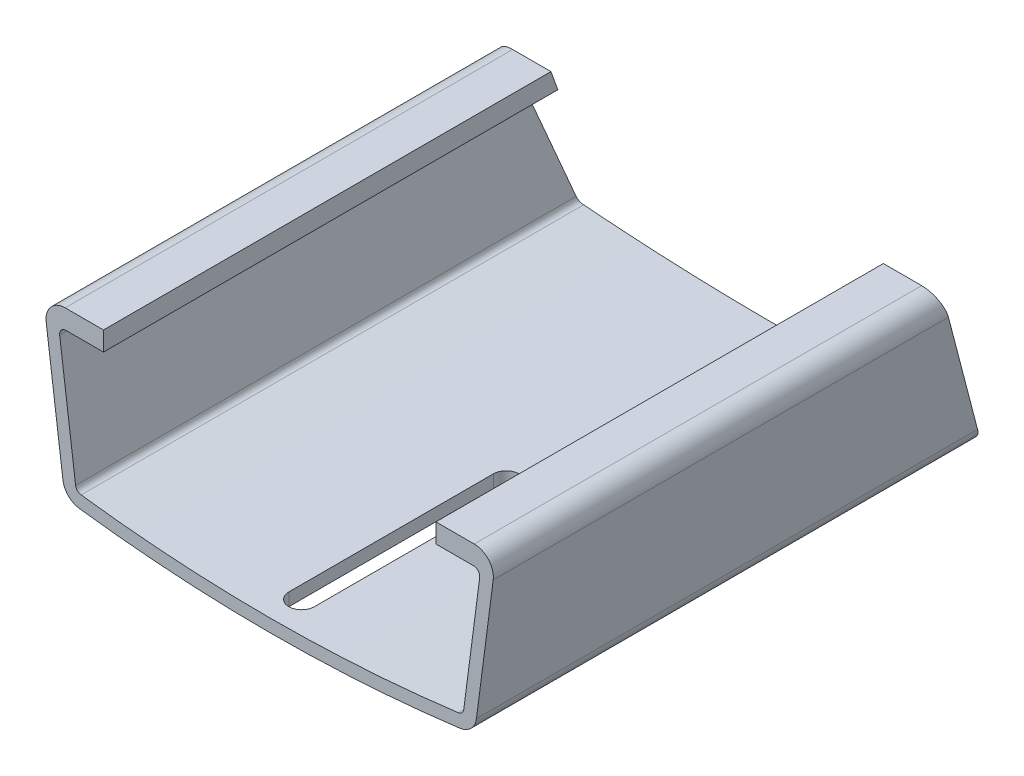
ISO-10303-21;
HEADER;
FILE_DESCRIPTION(('STEP AP214'),'2;1');
FILE_NAME('part.step','',(''),(''),'','','');
FILE_SCHEMA(('AUTOMOTIVE_DESIGN { 1 0 10303 214 1 1 1 1 }'));
ENDSEC;
DATA;
#1=APPLICATION_CONTEXT('core data for automotive mechanical design processes');
#2=APPLICATION_PROTOCOL_DEFINITION('international standard','automotive_design',2000,#1);
#3=PRODUCT_CONTEXT('',#1,'mechanical');
#4=PRODUCT('Part','Part','',(#3));
#5=PRODUCT_RELATED_PRODUCT_CATEGORY('part','',(#4));
#6=PRODUCT_DEFINITION_FORMATION('','',#4);
#7=PRODUCT_DEFINITION_CONTEXT('part definition',#1,'design');
#8=PRODUCT_DEFINITION('design','',#6,#7);
#9=PRODUCT_DEFINITION_SHAPE('','',#8);
#10=(LENGTH_UNIT() NAMED_UNIT(*) SI_UNIT(.MILLI.,.METRE.));
#11=(NAMED_UNIT(*) PLANE_ANGLE_UNIT() SI_UNIT($,.RADIAN.));
#12=(NAMED_UNIT(*) SI_UNIT($,.STERADIAN.) SOLID_ANGLE_UNIT());
#13=UNCERTAINTY_MEASURE_WITH_UNIT(LENGTH_MEASURE(1.E-05),#10,'distance_accuracy_value','');
#14=(GEOMETRIC_REPRESENTATION_CONTEXT(3) GLOBAL_UNCERTAINTY_ASSIGNED_CONTEXT((#13)) GLOBAL_UNIT_ASSIGNED_CONTEXT((#10,
#11,#12)) REPRESENTATION_CONTEXT('',''));
#15=CARTESIAN_POINT('',(0.,0.,0.));
#16=DIRECTION('',(0.,0.,1.));
#17=DIRECTION('',(1.,0.,0.));
#18=AXIS2_PLACEMENT_3D('',#15,#16,#17);
#19=CARTESIAN_POINT('',(-29.3686974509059,2.89162279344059,80.));
#20=DIRECTION('',(0.,0.,-1.));
#21=DIRECTION('',(-1.,0.,0.));
#22=AXIS2_PLACEMENT_3D('',#19,#20,#21);
#23=CYLINDRICAL_SURFACE('',#22,1.00000000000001);
#24=DIRECTION('',(0.,0.,-1.));
#25=VECTOR('',#24,1.);
#26=CARTESIAN_POINT('',(-29.4969842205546,1.89988567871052,80.));
#27=LINE('',#26,#25);
#28=CARTESIAN_POINT('',(-29.4969842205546,1.89988567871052,80.));
#29=VERTEX_POINT('',#28);
#30=CARTESIAN_POINT('',(-29.4969842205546,1.89988567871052,1.39281631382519));
#31=VERTEX_POINT('',#30);
#32=EDGE_CURVE('E401',#29,#31,#27,.T.);
#33=ORIENTED_EDGE('',*,*,#32,.T.);
#34=CARTESIAN_POINT('',(-29.3686974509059,2.89162279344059,1.74700814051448));
#35=DIRECTION('',(0.,-0.336336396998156,0.941741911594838));
#36=DIRECTION('',(0.,-0.941741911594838,-0.336336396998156));
#37=AXIS2_PLACEMENT_3D('',#34,#35,#36);
#38=ELLIPSE('',#37,1.0618620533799,1.00000000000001);
#39=CARTESIAN_POINT('',(-30.3602978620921,2.76228360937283,1.70081557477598));
#40=VERTEX_POINT('',#39);
#41=EDGE_CURVE('E330',#31,#40,#38,.F.);
#42=ORIENTED_EDGE('',*,*,#41,.T.);
#43=DIRECTION('',(0.,0.,-1.));
#44=VECTOR('',#43,1.);
#45=CARTESIAN_POINT('',(-30.3602978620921,2.76228360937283,80.));
#46=LINE('',#45,#44);
#47=CARTESIAN_POINT('',(-30.3602978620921,2.76228360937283,80.));
#48=VERTEX_POINT('',#47);
#49=EDGE_CURVE('E220',#48,#40,#46,.T.);
#50=ORIENTED_EDGE('',*,*,#49,.F.);
#51=CARTESIAN_POINT('',(-29.3686974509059,2.89162279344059,80.));
#52=DIRECTION('',(0.,0.,-1.));
#53=DIRECTION('',(1.,0.,0.));
#54=AXIS2_PLACEMENT_3D('',#51,#52,#53);
#55=CIRCLE('',#54,1.00000000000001);
#56=EDGE_CURVE('E284',#29,#48,#55,.T.);
#57=ORIENTED_EDGE('',*,*,#56,.F.);
#58=EDGE_LOOP('',(#33,#42,#50,#57));
#59=FACE_BOUND('',#58,.T.);
#60=ADVANCED_FACE('F31',(#59),#23,.F.);
#61=CARTESIAN_POINT('',(-30.3602978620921,2.76228360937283,80.));
#62=DIRECTION('',(-0.991600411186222,-0.129339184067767,0.));
#63=DIRECTION('',(0.129339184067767,-0.991600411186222,0.));
#64=AXIS2_PLACEMENT_3D('',#61,#62,#63);
#65=PLANE('',#64);
#66=ORIENTED_EDGE('',*,*,#49,.T.);
#67=DIRECTION('',(-0.121919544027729,0.934716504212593,0.333827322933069));
#68=VECTOR('',#67,1.);
#69=CARTESIAN_POINT('',(-33.5470805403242,27.1942841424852,10.4265300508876));
#70=LINE('',#69,#68);
#71=CARTESIAN_POINT('',(-32.8526948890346,21.8706608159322,8.52523600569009));
#72=VERTEX_POINT('',#71);
#73=EDGE_CURVE('E325',#40,#72,#70,.T.);
#74=ORIENTED_EDGE('',*,*,#73,.T.);
#75=DIRECTION('',(0.,0.,-1.));
#76=VECTOR('',#75,1.);
#77=CARTESIAN_POINT('',(-32.8526948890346,21.8706608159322,80.));
#78=LINE('',#77,#76);
#79=CARTESIAN_POINT('',(-32.8526948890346,21.8706608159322,80.));
#80=VERTEX_POINT('',#79);
#81=EDGE_CURVE('E437',#80,#72,#78,.T.);
#82=ORIENTED_EDGE('',*,*,#81,.F.);
#83=DIRECTION('',(-0.129339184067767,0.991600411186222,0.));
#84=VECTOR('',#83,1.);
#85=CARTESIAN_POINT('',(-30.3602978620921,2.76228360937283,80.));
#86=LINE('',#85,#84);
#87=EDGE_CURVE('E444',#48,#80,#86,.T.);
#88=ORIENTED_EDGE('',*,*,#87,.F.);
#89=EDGE_LOOP('',(#66,#74,#82,#88));
#90=FACE_BOUND('',#89,.T.);
#91=ADVANCED_FACE('F442',(#90),#65,.F.);
#92=CARTESIAN_POINT('',(-31.8610944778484,22.,80.));
#93=DIRECTION('',(0.,0.,-1.));
#94=DIRECTION('',(-1.,0.,0.));
#95=AXIS2_PLACEMENT_3D('',#92,#93,#94);
#96=CYLINDRICAL_SURFACE('',#95,0.999999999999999);
#97=ORIENTED_EDGE('',*,*,#81,.T.);
#98=CARTESIAN_POINT('',(-31.8610944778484,22.,8.57142857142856));
#99=DIRECTION('',(0.,-0.336336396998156,0.941741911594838));
#100=DIRECTION('',(0.,-0.941741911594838,-0.336336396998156));
#101=AXIS2_PLACEMENT_3D('',#98,#99,#100);
#102=ELLIPSE('',#101,1.06186205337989,0.999999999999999);
#103=CARTESIAN_POINT('',(-31.8610944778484,23.,8.92857142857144));
#104=VERTEX_POINT('',#103);
#105=EDGE_CURVE('E320',#72,#104,#102,.F.);
#106=ORIENTED_EDGE('',*,*,#105,.T.);
#107=DIRECTION('',(0.,0.,-1.));
#108=VECTOR('',#107,1.);
#109=CARTESIAN_POINT('',(-31.8610944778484,23.,80.));
#110=LINE('',#109,#108);
#111=CARTESIAN_POINT('',(-31.8610944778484,23.,80.));
#112=VERTEX_POINT('',#111);
#113=EDGE_CURVE('E435',#112,#104,#110,.T.);
#114=ORIENTED_EDGE('',*,*,#113,.F.);
#115=CARTESIAN_POINT('',(-31.8610944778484,22.,80.));
#116=DIRECTION('',(0.,0.,-1.));
#117=DIRECTION('',(1.,0.,0.));
#118=AXIS2_PLACEMENT_3D('',#115,#116,#117);
#119=CIRCLE('',#118,0.999999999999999);
#120=EDGE_CURVE('E470',#80,#112,#119,.T.);
#121=ORIENTED_EDGE('',*,*,#120,.F.);
#122=EDGE_LOOP('',(#97,#106,#114,#121));
#123=FACE_BOUND('',#122,.T.);
#124=ADVANCED_FACE('F505',(#123),#96,.F.);
#125=CARTESIAN_POINT('',(-31.8610944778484,23.,80.));
#126=DIRECTION('',(0.,1.,0.));
#127=DIRECTION('',(0.,0.,1.));
#128=AXIS2_PLACEMENT_3D('',#125,#126,#127);
#129=PLANE('',#128);
#130=ORIENTED_EDGE('',*,*,#113,.T.);
#131=DIRECTION('',(1.,0.,0.));
#132=VECTOR('',#131,1.);
#133=CARTESIAN_POINT('',(-31.8610944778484,23.,8.92857142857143));
#134=LINE('',#133,#132);
#135=CARTESIAN_POINT('',(-26.,23.,8.92857142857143));
#136=VERTEX_POINT('',#135);
#137=EDGE_CURVE('E316',#104,#136,#134,.T.);
#138=ORIENTED_EDGE('',*,*,#137,.T.);
#139=DIRECTION('',(0.,0.,-1.));
#140=VECTOR('',#139,1.);
#141=CARTESIAN_POINT('',(-26.,23.,80.));
#142=LINE('',#141,#140);
#143=CARTESIAN_POINT('',(-26.,23.,80.));
#144=VERTEX_POINT('',#143);
#145=EDGE_CURVE('E433',#144,#136,#142,.T.);
#146=ORIENTED_EDGE('',*,*,#145,.F.);
#147=DIRECTION('',(1.,0.,0.));
#148=VECTOR('',#147,1.);
#149=CARTESIAN_POINT('',(-31.8610944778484,23.,80.));
#150=LINE('',#149,#148);
#151=EDGE_CURVE('E471',#112,#144,#150,.T.);
#152=ORIENTED_EDGE('',*,*,#151,.F.);
#153=EDGE_LOOP('',(#130,#138,#146,#152));
#154=FACE_BOUND('',#153,.T.);
#155=ADVANCED_FACE('F498',(#154),#129,.F.);
#156=CARTESIAN_POINT('',(-26.,23.,80.));
#157=DIRECTION('',(-1.,0.,0.));
#158=DIRECTION('',(0.,0.,1.));
#159=AXIS2_PLACEMENT_3D('',#156,#157,#158);
#160=PLANE('',#159);
#161=ORIENTED_EDGE('',*,*,#145,.T.);
#162=DIRECTION('',(0.,0.941741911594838,0.336336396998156));
#163=VECTOR('',#162,1.);
#164=CARTESIAN_POINT('',(-26.,45.5113122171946,16.9683257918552));
#165=LINE('',#164,#163);
#166=CARTESIAN_POINT('',(-26.,26.,10.));
#167=VERTEX_POINT('',#166);
#168=EDGE_CURVE('E313',#136,#167,#165,.T.);
#169=ORIENTED_EDGE('',*,*,#168,.T.);
#170=DIRECTION('',(0.,0.,-1.));
#171=VECTOR('',#170,1.);
#172=CARTESIAN_POINT('',(-26.,26.,80.));
#173=LINE('',#172,#171);
#174=CARTESIAN_POINT('',(-26.,26.,80.));
#175=VERTEX_POINT('',#174);
#176=EDGE_CURVE('E209',#175,#167,#173,.T.);
#177=ORIENTED_EDGE('',*,*,#176,.F.);
#178=DIRECTION('',(0.,1.,0.));
#179=VECTOR('',#178,1.);
#180=CARTESIAN_POINT('',(-26.,23.,80.));
#181=LINE('',#180,#179);
#182=EDGE_CURVE('E475',#144,#175,#181,.T.);
#183=ORIENTED_EDGE('',*,*,#182,.F.);
#184=EDGE_LOOP('',(#161,#169,#177,#183));
#185=FACE_BOUND('',#184,.T.);
#186=ADVANCED_FACE('F496',(#185),#160,.F.);
#187=CARTESIAN_POINT('',(-26.,26.,80.));
#188=DIRECTION('',(0.,-1.,0.));
#189=DIRECTION('',(0.,0.,-1.));
#190=AXIS2_PLACEMENT_3D('',#187,#188,#189);
#191=PLANE('',#190);
#192=ORIENTED_EDGE('',*,*,#176,.T.);
#193=DIRECTION('',(1.,0.,0.));
#194=VECTOR('',#193,1.);
#195=CARTESIAN_POINT('',(-34.9915292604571,26.,10.));
#196=LINE('',#195,#194);
#197=CARTESIAN_POINT('',(-31.9915292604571,26.,10.));
#198=VERTEX_POINT('',#197);
#199=EDGE_CURVE('E192',#198,#167,#196,.T.);
#200=ORIENTED_EDGE('',*,*,#199,.F.);
#201=DIRECTION('',(0.,0.,-1.));
#202=VECTOR('',#201,1.);
#203=CARTESIAN_POINT('',(-31.9915292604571,26.,80.));
#204=LINE('',#203,#202);
#205=CARTESIAN_POINT('',(-31.9915292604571,26.,80.));
#206=VERTEX_POINT('',#205);
#207=EDGE_CURVE('E206',#198,#206,#204,.F.);
#208=ORIENTED_EDGE('',*,*,#207,.T.);
#209=DIRECTION('',(-1.,0.,0.));
#210=VECTOR('',#209,1.);
#211=CARTESIAN_POINT('',(-26.,26.,80.));
#212=LINE('',#211,#210);
#213=EDGE_CURVE('E477',#175,#206,#212,.T.);
#214=ORIENTED_EDGE('',*,*,#213,.F.);
#215=EDGE_LOOP('',(#192,#200,#208,#214));
#216=FACE_BOUND('',#215,.T.);
#217=ADVANCED_FACE('F204',(#216),#191,.F.);
#218=CARTESIAN_POINT('',(-32.3434986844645,2.50360524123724,80.));
#219=DIRECTION('',(0.991600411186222,0.129339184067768,0.));
#220=DIRECTION('',(-0.129339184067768,0.991600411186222,0.));
#221=AXIS2_PLACEMENT_3D('',#218,#219,#220);
#222=PLANE('',#221);
#223=DIRECTION('',(0.,0.,-1.));
#224=VECTOR('',#223,1.);
#225=CARTESIAN_POINT('',(-34.9663304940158,22.6119824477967,80.));
#226=LINE('',#225,#224);
#227=CARTESIAN_POINT('',(-34.9663304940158,22.6119824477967,80.));
#228=VERTEX_POINT('',#227);
#229=CARTESIAN_POINT('',(-34.9663304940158,22.6119824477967,8.78999373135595));
#230=VERTEX_POINT('',#229);
#231=EDGE_CURVE('E217',#228,#230,#226,.T.);
#232=ORIENTED_EDGE('',*,*,#231,.T.);
#233=DIRECTION('',(0.12191954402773,-0.934716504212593,-0.333827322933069));
#234=VECTOR('',#233,1.);
#235=CARTESIAN_POINT('',(-35.5340414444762,26.9644330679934,10.3444403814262));
#236=LINE('',#235,#234);
#237=CARTESIAN_POINT('',(-32.3434986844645,2.50360524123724,1.608430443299));
#238=VERTEX_POINT('',#237);
#239=EDGE_CURVE('E195',#230,#238,#236,.T.);
#240=ORIENTED_EDGE('',*,*,#239,.T.);
#241=DIRECTION('',(0.,0.,-1.));
#242=VECTOR('',#241,1.);
#243=CARTESIAN_POINT('',(-32.3434986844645,2.50360524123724,80.));
#244=LINE('',#243,#242);
#245=CARTESIAN_POINT('',(-32.3434986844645,2.50360524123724,80.));
#246=VERTEX_POINT('',#245);
#247=EDGE_CURVE('E429',#246,#238,#244,.T.);
#248=ORIENTED_EDGE('',*,*,#247,.F.);
#249=DIRECTION('',(0.129339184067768,-0.991600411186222,0.));
#250=VECTOR('',#249,1.);
#251=CARTESIAN_POINT('',(-32.3434986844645,2.50360524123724,80.));
#252=LINE('',#251,#250);
#253=EDGE_CURVE('E479',#228,#246,#252,.T.);
#254=ORIENTED_EDGE('',*,*,#253,.F.);
#255=EDGE_LOOP('',(#232,#240,#248,#254));
#256=FACE_BOUND('',#255,.T.);
#257=ADVANCED_FACE('F493',(#256),#222,.F.);
#258=CARTESIAN_POINT('',(-29.3686974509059,2.89162279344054,80.));
#259=DIRECTION('',(0.,0.,-1.));
#260=DIRECTION('',(-1.,0.,0.));
#261=AXIS2_PLACEMENT_3D('',#258,#259,#260);
#262=CYLINDRICAL_SURFACE('',#261,2.99999999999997);
#263=ORIENTED_EDGE('',*,*,#247,.T.);
#264=CARTESIAN_POINT('',(-29.3686974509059,2.89162279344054,1.74700814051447));
#265=DIRECTION('',(0.,-0.336336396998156,0.941741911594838));
#266=DIRECTION('',(0.,-0.941741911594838,-0.336336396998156));
#267=AXIS2_PLACEMENT_3D('',#264,#265,#266);
#268=ELLIPSE('',#267,3.18558616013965,2.99999999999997);
#269=CARTESIAN_POINT('',(-29.7535577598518,-0.0835885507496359,0.684432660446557));
#270=VERTEX_POINT('',#269);
#271=EDGE_CURVE('E351',#238,#270,#268,.T.);
#272=ORIENTED_EDGE('',*,*,#271,.T.);
#273=DIRECTION('',(0.,0.,-1.));
#274=VECTOR('',#273,1.);
#275=CARTESIAN_POINT('',(-29.7535577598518,-0.0835885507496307,80.));
#276=LINE('',#275,#274);
#277=CARTESIAN_POINT('',(-29.7535577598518,-0.0835885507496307,80.));
#278=VERTEX_POINT('',#277);
#279=EDGE_CURVE('E426',#278,#270,#276,.T.);
#280=ORIENTED_EDGE('',*,*,#279,.F.);
#281=CARTESIAN_POINT('',(-29.3686974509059,2.89162279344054,80.));
#282=DIRECTION('',(0.,0.,1.));
#283=DIRECTION('',(1.,0.,0.));
#284=AXIS2_PLACEMENT_3D('',#281,#282,#283);
#285=CIRCLE('',#284,2.99999999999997);
#286=EDGE_CURVE('E481',#246,#278,#285,.T.);
#287=ORIENTED_EDGE('',*,*,#286,.F.);
#288=EDGE_LOOP('',(#263,#272,#280,#287));
#289=FACE_BOUND('',#288,.T.);
#290=ADVANCED_FACE('F275',(#289),#262,.T.);
#291=CARTESIAN_POINT('',(0.,229.930056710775,80.));
#292=DIRECTION('',(0.,0.,-1.));
#293=DIRECTION('',(-1.,0.,0.));
#294=AXIS2_PLACEMENT_3D('',#291,#292,#293);
#295=CYLINDRICAL_SURFACE('',#294,231.930056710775);
#296=DIRECTION('',(0.,0.,-1.));
#297=VECTOR('',#296,1.);
#298=CARTESIAN_POINT('',(2.00000000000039,-1.99137655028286,80.));
#299=LINE('',#298,#297);
#300=CARTESIAN_POINT('',(2.00000000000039,-1.99137655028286,75.));
#301=VERTEX_POINT('',#300);
#302=CARTESIAN_POINT('',(2.00000000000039,-1.99137655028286,43.));
#303=VERTEX_POINT('',#302);
#304=EDGE_CURVE('E266',#301,#303,#299,.T.);
#305=ORIENTED_EDGE('',*,*,#304,.T.);
#306=CARTESIAN_POINT('',(2.00000000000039,-1.99137655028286,43.));
#307=CARTESIAN_POINT('',(1.99999962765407,-1.99137643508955,42.943733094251));
#308=CARTESIAN_POINT('',(1.99762403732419,-1.99139705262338,42.8874931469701));
#309=CARTESIAN_POINT('',(1.98814684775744,-1.99147853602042,42.7754156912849));
#310=CARTESIAN_POINT('',(1.98104547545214,-1.991539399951,42.7195781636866));
#311=CARTESIAN_POINT('',(1.95271918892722,-1.9917802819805,42.5533610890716));
#312=CARTESIAN_POINT('',(1.92447192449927,-1.99201859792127,42.4440950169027));
#313=CARTESIAN_POINT('',(1.85003577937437,-1.99262424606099,42.2318613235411));
#314=CARTESIAN_POINT('',(1.80383858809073,-1.99299163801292,42.1288966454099));
#315=CARTESIAN_POINT('',(1.69482021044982,-1.9938138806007,41.9321895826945));
#316=CARTESIAN_POINT('',(1.63200228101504,-1.99426871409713,41.838445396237));
#317=CARTESIAN_POINT('',(1.49151930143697,-1.99521464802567,41.6628323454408));
#318=CARTESIAN_POINT('',(1.41385358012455,-1.99570575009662,41.5809640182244));
#319=CARTESIAN_POINT('',(1.24586778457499,-1.99666891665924,41.4314144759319));
#320=CARTESIAN_POINT('',(1.15554578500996,-1.9971409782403,41.3637354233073));
#321=CARTESIAN_POINT('',(0.964823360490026,-1.99801274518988,41.2445047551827));
#322=CARTESIAN_POINT('',(0.864423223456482,-1.99841245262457,41.1929526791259));
#323=CARTESIAN_POINT('',(0.656399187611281,-1.99909443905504,41.1074393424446));
#324=CARTESIAN_POINT('',(0.548775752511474,-1.99937672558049,41.0734769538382));
#325=CARTESIAN_POINT('',(0.329354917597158,-1.99979208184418,41.0241024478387));
#326=CARTESIAN_POINT('',(0.217557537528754,-1.99992515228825,41.0086902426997));
#327=CARTESIAN_POINT('',(-0.00704057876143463,-2.00002707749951,40.9968532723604));
#328=CARTESIAN_POINT('',(-0.119841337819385,-1.99999592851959,41.0004289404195));
#329=CARTESIAN_POINT('',(-0.34323723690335,-1.99977292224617,41.0264667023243));
#330=CARTESIAN_POINT('',(-0.453832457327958,-1.99958107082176,41.0489281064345));
#331=CARTESIAN_POINT('',(-0.669681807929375,-1.99905829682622,41.1120986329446));
#332=CARTESIAN_POINT('',(-0.774935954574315,-1.99872737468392,41.1528076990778));
#333=CARTESIAN_POINT('',(-0.977119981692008,-1.99796374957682,41.2513196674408));
#334=CARTESIAN_POINT('',(-1.07404953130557,-1.99753104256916,41.3091232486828));
#335=CARTESIAN_POINT('',(-1.25682387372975,-1.99661266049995,41.440180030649));
#336=CARTESIAN_POINT('',(-1.3426692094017,-1.9961269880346,41.5134324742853));
#337=CARTESIAN_POINT('',(-1.50083614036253,-1.995157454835,41.6732994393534));
#338=CARTESIAN_POINT('',(-1.57315911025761,-1.99467359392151,41.7599126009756));
#339=CARTESIAN_POINT('',(-1.70226068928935,-1.99376202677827,41.9440854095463));
#340=CARTESIAN_POINT('',(-1.75903435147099,-1.99333433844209,42.0416485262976));
#341=CARTESIAN_POINT('',(-1.855422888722,-1.99258329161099,42.2449633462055));
#342=CARTESIAN_POINT('',(-1.89502730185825,-1.99225999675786,42.3507199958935));
#343=CARTESIAN_POINT('',(-1.95585799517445,-1.99175504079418,42.5672991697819));
#344=CARTESIAN_POINT('',(-1.97711234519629,-1.99157316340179,42.6781136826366));
#345=CARTESIAN_POINT('',(-1.99261621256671,-1.99144011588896,42.8247205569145));
#346=CARTESIAN_POINT('',(-1.99538659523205,-1.99141629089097,42.8597500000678));
#347=CARTESIAN_POINT('',(-1.99907596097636,-1.99138452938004,42.9298482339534));
#348=CARTESIAN_POINT('',(-1.99999799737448,-1.99137656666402,42.9649168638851));
#349=CARTESIAN_POINT('',(-1.99999999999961,-1.99137655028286,43.));
#350=B_SPLINE_CURVE_WITH_KNOTS('',3,(#306,#307,#308,#309,#310,#311,#312,#313,#314,#315,#316,
#317,#318,#319,#320,#321,#322,#323,#324,#325,#326,#327,#328,#329,#330,#331,#332,#333,#334,#335,
#336,#337,#338,#339,#340,#341,#342,#343,#344,#345,#346,#347,#348,#349),.UNSPECIFIED.,.F.,.F.,(4,
2,2,2,2,2,2,2,2,2,2,2,2,2,2,2,2,2,2,2,2,4),(0.,0.16869703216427,0.337385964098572,
0.674224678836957,1.01121953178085,1.3481483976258,1.6850924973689,2.02208791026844,
2.35907369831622,2.69603787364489,3.03300045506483,3.36997072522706,3.70692868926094,
4.04388561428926,4.38085592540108,4.71780972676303,5.05472925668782,5.39175585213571,
5.72898752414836,6.06570241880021,6.17108493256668,6.27629321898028),.UNSPECIFIED.);
#351=CARTESIAN_POINT('',(-1.99999999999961,-1.99137655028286,43.));
#352=VERTEX_POINT('',#351);
#353=EDGE_CURVE('E258',#303,#352,#350,.T.);
#354=ORIENTED_EDGE('',*,*,#353,.T.);
#355=DIRECTION('',(0.,0.,-1.));
#356=VECTOR('',#355,1.);
#357=CARTESIAN_POINT('',(-1.99999999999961,-1.99137655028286,80.));
#358=LINE('',#357,#356);
#359=CARTESIAN_POINT('',(-1.99999999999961,-1.99137655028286,75.));
#360=VERTEX_POINT('',#359);
#361=EDGE_CURVE('E265',#352,#360,#358,.F.);
#362=ORIENTED_EDGE('',*,*,#361,.T.);
#363=CARTESIAN_POINT('',(3.89046133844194E-13,-2.00000000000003,77.));
#364=CARTESIAN_POINT('',(0.112338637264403,-1.99999988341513,76.9999950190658));
#365=CARTESIAN_POINT('',(0.224758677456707,-1.99991750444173,76.9905032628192));
#366=CARTESIAN_POINT('',(0.446502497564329,-1.99959679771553,76.952770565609));
#367=CARTESIAN_POINT('',(0.555822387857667,-1.99935828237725,76.9245070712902));
#368=CARTESIAN_POINT('',(0.768121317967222,-1.99875232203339,76.8500356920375));
#369=CARTESIAN_POINT('',(0.87110336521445,-1.99838493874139,76.8038363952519));
#370=CARTESIAN_POINT('',(1.06782073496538,-1.99756271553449,76.6948166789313));
#371=CARTESIAN_POINT('',(1.16155834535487,-1.99710789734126,76.6320003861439));
#372=CARTESIAN_POINT('',(1.33717117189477,-1.9961619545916,76.4915153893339));
#373=CARTESIAN_POINT('',(1.41904486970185,-1.99567082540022,76.4138447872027));
#374=CARTESIAN_POINT('',(1.56859359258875,-1.99470765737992,76.2458575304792));
#375=CARTESIAN_POINT('',(1.63626805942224,-1.99423561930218,76.1555403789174));
#376=CARTESIAN_POINT('',(1.75549328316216,-1.99336387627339,75.9648263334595));
#377=CARTESIAN_POINT('',(1.8070440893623,-1.99296417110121,75.8644294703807));
#378=CARTESIAN_POINT('',(1.89255857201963,-1.99228215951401,75.6564058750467));
#379=CARTESIAN_POINT('',(1.92652228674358,-1.99199985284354,75.5487791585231));
#380=CARTESIAN_POINT('',(1.97589785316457,-1.9915844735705,75.3293535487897));
#381=CARTESIAN_POINT('',(1.99131013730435,-1.99145139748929,75.2175547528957));
#382=CARTESIAN_POINT('',(2.00314664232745,-1.99134947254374,74.9929566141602));
#383=CARTESIAN_POINT('',(1.99957090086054,-1.99138062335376,74.8801572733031));
#384=CARTESIAN_POINT('',(1.97353332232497,-1.99160363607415,74.6567630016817));
#385=CARTESIAN_POINT('',(1.9510719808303,-1.99179549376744,74.5461680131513));
#386=CARTESIAN_POINT('',(1.88790154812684,-1.99231828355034,74.3303186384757));
#387=CARTESIAN_POINT('',(1.84719243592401,-1.99264921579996,74.2250642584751));
#388=CARTESIAN_POINT('',(1.74868150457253,-1.99341284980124,74.0228824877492));
#389=CARTESIAN_POINT('',(1.69087945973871,-1.99384555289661,73.9259552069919));
#390=CARTESIAN_POINT('',(1.55982368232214,-1.99476394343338,73.7431803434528));
#391=CARTESIAN_POINT('',(1.48656995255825,-1.99524963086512,73.6573327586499));
#392=CARTESIAN_POINT('',(1.32668739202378,-1.99621925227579,73.4991512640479));
#393=CARTESIAN_POINT('',(1.2400581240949,-1.99670318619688,73.4268177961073));
#394=CARTESIAN_POINT('',(1.05588516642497,-1.99761472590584,73.2977212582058));
#395=CARTESIAN_POINT('',(0.958341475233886,-1.99804233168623,73.2409581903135));
#396=CARTESIAN_POINT('',(0.755108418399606,-1.99879300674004,73.1446138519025));
#397=CARTESIAN_POINT('',(0.649419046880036,-1.99911607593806,73.105032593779));
#398=CARTESIAN_POINT('',(0.432894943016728,-1.99962125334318,73.0441757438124));
#399=CARTESIAN_POINT('',(0.322060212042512,-1.99980336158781,73.0229001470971));
#400=CARTESIAN_POINT('',(0.0983954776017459,-2.00000608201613,72.999259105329));
#401=CARTESIAN_POINT('',(-0.0144344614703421,-2.00002669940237,72.9968930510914));
#402=CARTESIAN_POINT('',(-0.238890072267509,-1.99990412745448,73.0111366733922));
#403=CARTESIAN_POINT('',(-0.350515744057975,-1.99976093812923,73.0277463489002));
#404=CARTESIAN_POINT('',(-0.569392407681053,-1.9993268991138,73.0794694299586));
#405=CARTESIAN_POINT('',(-0.676643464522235,-1.99903605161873,73.1145825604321));
#406=CARTESIAN_POINT('',(-0.883728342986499,-1.99833948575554,73.2023155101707));
#407=CARTESIAN_POINT('',(-0.983562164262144,-1.99793376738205,73.2549353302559));
#408=CARTESIAN_POINT('',(-1.17298139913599,-1.99705318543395,73.3761895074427));
#409=CARTESIAN_POINT('',(-1.26256655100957,-1.99657832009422,73.4448242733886));
#410=CARTESIAN_POINT('',(-1.42894279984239,-1.99561298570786,73.5961594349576));
#411=CARTESIAN_POINT('',(-1.50573388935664,-1.99512251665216,73.6788598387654));
#412=CARTESIAN_POINT('',(-1.64434415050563,-1.99418125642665,73.8559812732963));
#413=CARTESIAN_POINT('',(-1.70616292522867,-1.99373046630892,73.9504026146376));
#414=CARTESIAN_POINT('',(-1.81307094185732,-1.9929194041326,74.1482838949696));
#415=CARTESIAN_POINT('',(-1.85816020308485,-1.99255913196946,74.2517438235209));
#416=CARTESIAN_POINT('',(-1.9303286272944,-1.99196973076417,74.464763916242));
#417=CARTESIAN_POINT('',(-1.95740805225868,-1.99174059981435,74.5743239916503));
#418=CARTESIAN_POINT('',(-1.99278899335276,-1.99143930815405,74.796435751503));
#419=CARTESIAN_POINT('',(-2.00109047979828,-1.9913671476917,74.9089874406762));
#420=CARTESIAN_POINT('',(-1.99867977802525,-1.99138793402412,75.133883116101));
#421=CARTESIAN_POINT('',(-1.98796824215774,-1.99148087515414,75.2462271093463));
#422=CARTESIAN_POINT('',(-1.94783684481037,-1.99182137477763,75.4675223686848));
#423=CARTESIAN_POINT('',(-1.91841694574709,-1.99206893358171,75.5764736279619));
#424=CARTESIAN_POINT('',(-1.84170342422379,-1.99269076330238,75.7878924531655));
#425=CARTESIAN_POINT('',(-1.79440947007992,-1.99306503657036,75.8903598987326));
#426=CARTESIAN_POINT('',(-1.68329242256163,-1.99389808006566,76.0858965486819));
#427=CARTESIAN_POINT('',(-1.61946997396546,-1.99435684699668,76.1789661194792));
#428=CARTESIAN_POINT('',(-1.47711280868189,-1.99530713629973,76.3530637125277));
#429=CARTESIAN_POINT('',(-1.3985791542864,-1.99579865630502,76.4340926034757));
#430=CARTESIAN_POINT('',(-1.229000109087,-1.9967591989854,76.5818363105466));
#431=CARTESIAN_POINT('',(-1.13795161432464,-1.99722821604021,76.6485475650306));
#432=CARTESIAN_POINT('',(-0.945909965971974,-1.99809095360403,76.7657636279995));
#433=CARTESIAN_POINT('',(-0.844911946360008,-1.99848463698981,76.8162604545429));
#434=CARTESIAN_POINT('',(-0.635950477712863,-1.99915154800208,76.8995229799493));
#435=CARTESIAN_POINT('',(-0.527995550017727,-1.99942491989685,76.9323099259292));
#436=CARTESIAN_POINT('',(-0.34946093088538,-1.9997469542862,76.9704876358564));
#437=CARTESIAN_POINT('',(-0.280041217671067,-1.99984143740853,76.9815409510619));
#438=CARTESIAN_POINT('',(-0.140424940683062,-1.99996799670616,76.996298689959));
#439=CARTESIAN_POINT('',(-0.0702283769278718,-2.00000007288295,77.0000031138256));
#440=CARTESIAN_POINT('',(3.89046133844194E-13,-2.00000000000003,77.));
#441=B_SPLINE_CURVE_WITH_KNOTS('',3,(#363,#364,#365,#366,#367,#368,#369,#370,#371,#372,#373,
#374,#375,#376,#377,#378,#379,#380,#381,#382,#383,#384,#385,#386,#387,#388,#389,#390,#391,#392,
#393,#394,#395,#396,#397,#398,#399,#400,#401,#402,#403,#404,#405,#406,#407,#408,#409,#410,#411,
#412,#413,#414,#415,#416,#417,#418,#419,#420,#421,#422,#423,#424,#425,#426,#427,#428,#429,#430,
#431,#432,#433,#434,#435,#436,#437,#438,#439,#440),.UNSPECIFIED.,.T.,.F.,(4,2,2,2,2,2,2,2,2,2,2,
2,2,2,2,2,2,2,2,2,2,2,2,2,2,2,2,2,2,2,2,2,2,2,2,2,2,2,4),(0.,0.336759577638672,
0.673924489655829,1.01092815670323,1.3478482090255,1.68481134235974,2.02178772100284,
2.35876306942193,2.6957376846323,3.03270444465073,3.36967053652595,3.70662778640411,
4.04358542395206,4.38054751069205,4.71750953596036,5.05448257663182,5.39145566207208,
5.72842899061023,6.06540222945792,6.40236461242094,6.73932697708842,7.07628433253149,
7.41324170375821,7.7502076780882,8.08717384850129,8.42414895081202,8.76112366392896,
9.09809347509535,9.43506381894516,9.77202260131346,10.1089820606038,10.4459477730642,
10.7829003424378,11.119828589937,11.4568405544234,11.7940181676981,12.1307903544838,
12.341315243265,12.5518401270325),.UNSPECIFIED.);
#442=EDGE_CURVE('E280',#360,#301,#441,.T.);
#443=ORIENTED_EDGE('',*,*,#442,.T.);
#444=EDGE_LOOP('',(#305,#354,#362,#443));
#445=FACE_BOUND('',#444,.T.);
#446=CARTESIAN_POINT('',(0.,229.930056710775,82.8321631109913));
#447=DIRECTION('',(0.,-0.336336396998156,0.941741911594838));
#448=DIRECTION('',(0.,-0.941741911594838,-0.336336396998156));
#449=AXIS2_PLACEMENT_3D('',#446,#447,#448);
#450=ELLIPSE('',#449,246.277726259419,231.930056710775);
#451=CARTESIAN_POINT('',(29.7535577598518,-0.0835885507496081,0.684432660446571));
#452=VERTEX_POINT('',#451);
#453=EDGE_CURVE('E354',#270,#452,#450,.T.);
#454=ORIENTED_EDGE('',*,*,#453,.T.);
#455=DIRECTION('',(0.,0.,-1.));
#456=VECTOR('',#455,1.);
#457=CARTESIAN_POINT('',(29.7535577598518,-0.0835885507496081,80.));
#458=LINE('',#457,#456);
#459=CARTESIAN_POINT('',(29.7535577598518,-0.0835885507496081,80.));
#460=VERTEX_POINT('',#459);
#461=EDGE_CURVE('E423',#460,#452,#458,.T.);
#462=ORIENTED_EDGE('',*,*,#461,.F.);
#463=CARTESIAN_POINT('',(0.,229.930056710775,80.));
#464=DIRECTION('',(0.,0.,1.));
#465=DIRECTION('',(1.,0.,0.));
#466=AXIS2_PLACEMENT_3D('',#463,#464,#465);
#467=CIRCLE('',#466,231.930056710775);
#468=EDGE_CURVE('E386',#278,#460,#467,.T.);
#469=ORIENTED_EDGE('',*,*,#468,.F.);
#470=ORIENTED_EDGE('',*,*,#279,.T.);
#471=EDGE_LOOP('',(#454,#462,#469,#470));
#472=FACE_BOUND('',#471,.T.);
#473=ADVANCED_FACE('F269',(#445,#472),#295,.T.);
#474=CARTESIAN_POINT('',(29.3686974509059,2.89162279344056,80.));
#475=DIRECTION('',(0.,0.,-1.));
#476=DIRECTION('',(-1.,0.,0.));
#477=AXIS2_PLACEMENT_3D('',#474,#475,#476);
#478=CYLINDRICAL_SURFACE('',#477,2.99999999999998);
#479=ORIENTED_EDGE('',*,*,#461,.T.);
#480=CARTESIAN_POINT('',(29.3686974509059,2.89162279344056,1.74700814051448));
#481=DIRECTION('',(0.,-0.336336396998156,0.941741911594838));
#482=DIRECTION('',(0.,-0.941741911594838,-0.336336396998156));
#483=AXIS2_PLACEMENT_3D('',#480,#481,#482);
#484=ELLIPSE('',#483,3.18558616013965,2.99999999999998);
#485=CARTESIAN_POINT('',(32.3434986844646,2.50360524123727,1.60843044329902));
#486=VERTEX_POINT('',#485);
#487=EDGE_CURVE('E356',#452,#486,#484,.T.);
#488=ORIENTED_EDGE('',*,*,#487,.T.);
#489=DIRECTION('',(0.,0.,-1.));
#490=VECTOR('',#489,1.);
#491=CARTESIAN_POINT('',(32.3434986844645,2.50360524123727,80.));
#492=LINE('',#491,#490);
#493=CARTESIAN_POINT('',(32.3434986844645,2.50360524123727,80.));
#494=VERTEX_POINT('',#493);
#495=EDGE_CURVE('E421',#494,#486,#492,.T.);
#496=ORIENTED_EDGE('',*,*,#495,.F.);
#497=CARTESIAN_POINT('',(29.3686974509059,2.89162279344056,80.));
#498=DIRECTION('',(0.,0.,1.));
#499=DIRECTION('',(-1.,0.,0.));
#500=AXIS2_PLACEMENT_3D('',#497,#498,#499);
#501=CIRCLE('',#500,2.99999999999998);
#502=EDGE_CURVE('E381',#460,#494,#501,.T.);
#503=ORIENTED_EDGE('',*,*,#502,.F.);
#504=EDGE_LOOP('',(#479,#488,#496,#503));
#505=FACE_BOUND('',#504,.T.);
#506=ADVANCED_FACE('F274',(#505),#478,.T.);
#507=CARTESIAN_POINT('',(32.3434986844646,2.50360524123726,80.));
#508=DIRECTION('',(-0.991600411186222,0.129339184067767,0.));
#509=DIRECTION('',(-0.129339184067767,-0.991600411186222,0.));
#510=AXIS2_PLACEMENT_3D('',#507,#508,#509);
#511=PLANE('',#510);
#512=ORIENTED_EDGE('',*,*,#495,.T.);
#513=DIRECTION('',(0.121919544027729,0.934716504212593,0.333827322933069));
#514=VECTOR('',#513,1.);
#515=CARTESIAN_POINT('',(35.5340414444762,26.9644330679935,10.3444403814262));
#516=LINE('',#515,#514);
#517=CARTESIAN_POINT('',(34.9663304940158,22.6119824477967,8.78999373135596));
#518=VERTEX_POINT('',#517);
#519=EDGE_CURVE('E210',#486,#518,#516,.T.);
#520=ORIENTED_EDGE('',*,*,#519,.T.);
#521=DIRECTION('',(0.,0.,-1.));
#522=VECTOR('',#521,1.);
#523=CARTESIAN_POINT('',(34.9663304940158,22.6119824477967,80.));
#524=LINE('',#523,#522);
#525=CARTESIAN_POINT('',(34.9663304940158,22.6119824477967,80.));
#526=VERTEX_POINT('',#525);
#527=EDGE_CURVE('E228',#518,#526,#524,.F.);
#528=ORIENTED_EDGE('',*,*,#527,.T.);
#529=DIRECTION('',(0.129339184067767,0.991600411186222,0.));
#530=VECTOR('',#529,1.);
#531=CARTESIAN_POINT('',(32.3434986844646,2.50360524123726,80.));
#532=LINE('',#531,#530);
#533=EDGE_CURVE('E377',#494,#526,#532,.T.);
#534=ORIENTED_EDGE('',*,*,#533,.F.);
#535=EDGE_LOOP('',(#512,#520,#528,#534));
#536=FACE_BOUND('',#535,.T.);
#537=ADVANCED_FACE('F376',(#536),#511,.F.);
#538=CARTESIAN_POINT('',(26.,26.,80.));
#539=DIRECTION('',(0.,-1.,0.));
#540=DIRECTION('',(0.,0.,-1.));
#541=AXIS2_PLACEMENT_3D('',#538,#539,#540);
#542=PLANE('',#541);
#543=DIRECTION('',(0.,0.,-1.));
#544=VECTOR('',#543,1.);
#545=CARTESIAN_POINT('',(31.9915292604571,26.,80.));
#546=LINE('',#545,#544);
#547=CARTESIAN_POINT('',(31.9915292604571,26.,80.));
#548=VERTEX_POINT('',#547);
#549=CARTESIAN_POINT('',(31.9915292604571,26.,10.));
#550=VERTEX_POINT('',#549);
#551=EDGE_CURVE('E225',#548,#550,#546,.T.);
#552=ORIENTED_EDGE('',*,*,#551,.T.);
#553=CARTESIAN_POINT('',(26.,26.,10.));
#554=VERTEX_POINT('',#553);
#555=EDGE_CURVE('E211',#554,#550,#196,.T.);
#556=ORIENTED_EDGE('',*,*,#555,.F.);
#557=DIRECTION('',(0.,0.,-1.));
#558=VECTOR('',#557,1.);
#559=CARTESIAN_POINT('',(26.,26.,80.));
#560=LINE('',#559,#558);
#561=CARTESIAN_POINT('',(26.,26.,80.));
#562=VERTEX_POINT('',#561);
#563=EDGE_CURVE('E419',#562,#554,#560,.T.);
#564=ORIENTED_EDGE('',*,*,#563,.F.);
#565=DIRECTION('',(-1.,0.,0.));
#566=VECTOR('',#565,1.);
#567=CARTESIAN_POINT('',(26.,26.,80.));
#568=LINE('',#567,#566);
#569=EDGE_CURVE('E368',#548,#562,#568,.T.);
#570=ORIENTED_EDGE('',*,*,#569,.F.);
#571=EDGE_LOOP('',(#552,#556,#564,#570));
#572=FACE_BOUND('',#571,.T.);
#573=ADVANCED_FACE('F367',(#572),#542,.F.);
#574=CARTESIAN_POINT('',(26.,23.,80.));
#575=DIRECTION('',(1.,0.,0.));
#576=DIRECTION('',(0.,0.,-1.));
#577=AXIS2_PLACEMENT_3D('',#574,#575,#576);
#578=PLANE('',#577);
#579=ORIENTED_EDGE('',*,*,#563,.T.);
#580=DIRECTION('',(0.,-0.941741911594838,-0.336336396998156));
#581=VECTOR('',#580,1.);
#582=CARTESIAN_POINT('',(26.,45.5113122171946,16.9683257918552));
#583=LINE('',#582,#581);
#584=CARTESIAN_POINT('',(26.,23.,8.92857142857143));
#585=VERTEX_POINT('',#584);
#586=EDGE_CURVE('E333',#554,#585,#583,.T.);
#587=ORIENTED_EDGE('',*,*,#586,.T.);
#588=DIRECTION('',(0.,0.,-1.));
#589=VECTOR('',#588,1.);
#590=CARTESIAN_POINT('',(26.,23.,80.));
#591=LINE('',#590,#589);
#592=CARTESIAN_POINT('',(26.,23.,80.));
#593=VERTEX_POINT('',#592);
#594=EDGE_CURVE('E416',#593,#585,#591,.T.);
#595=ORIENTED_EDGE('',*,*,#594,.F.);
#596=DIRECTION('',(0.,-1.,0.));
#597=VECTOR('',#596,1.);
#598=CARTESIAN_POINT('',(26.,23.,80.));
#599=LINE('',#598,#597);
#600=EDGE_CURVE('E384',#562,#593,#599,.T.);
#601=ORIENTED_EDGE('',*,*,#600,.F.);
#602=EDGE_LOOP('',(#579,#587,#595,#601));
#603=FACE_BOUND('',#602,.T.);
#604=ADVANCED_FACE('F469',(#603),#578,.F.);
#605=CARTESIAN_POINT('',(31.8610944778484,23.,80.));
#606=DIRECTION('',(0.,1.,0.));
#607=DIRECTION('',(0.,0.,1.));
#608=AXIS2_PLACEMENT_3D('',#605,#606,#607);
#609=PLANE('',#608);
#610=ORIENTED_EDGE('',*,*,#594,.T.);
#611=DIRECTION('',(1.,0.,0.));
#612=VECTOR('',#611,1.);
#613=CARTESIAN_POINT('',(31.8610944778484,23.,8.92857142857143));
#614=LINE('',#613,#612);
#615=CARTESIAN_POINT('',(31.8610944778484,23.,8.92857142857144));
#616=VERTEX_POINT('',#615);
#617=EDGE_CURVE('E336',#585,#616,#614,.T.);
#618=ORIENTED_EDGE('',*,*,#617,.T.);
#619=DIRECTION('',(0.,0.,-1.));
#620=VECTOR('',#619,1.);
#621=CARTESIAN_POINT('',(31.8610944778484,23.,80.));
#622=LINE('',#621,#620);
#623=CARTESIAN_POINT('',(31.8610944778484,23.,80.));
#624=VERTEX_POINT('',#623);
#625=EDGE_CURVE('E413',#624,#616,#622,.T.);
#626=ORIENTED_EDGE('',*,*,#625,.F.);
#627=DIRECTION('',(1.,0.,0.));
#628=VECTOR('',#627,1.);
#629=CARTESIAN_POINT('',(31.8610944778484,23.,80.));
#630=LINE('',#629,#628);
#631=EDGE_CURVE('E391',#593,#624,#630,.T.);
#632=ORIENTED_EDGE('',*,*,#631,.F.);
#633=EDGE_LOOP('',(#610,#618,#626,#632));
#634=FACE_BOUND('',#633,.T.);
#635=ADVANCED_FACE('F464',(#634),#609,.F.);
#636=CARTESIAN_POINT('',(31.8610944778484,22.,80.));
#637=DIRECTION('',(0.,0.,-1.));
#638=DIRECTION('',(-1.,0.,0.));
#639=AXIS2_PLACEMENT_3D('',#636,#637,#638);
#640=CYLINDRICAL_SURFACE('',#639,0.999999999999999);
#641=ORIENTED_EDGE('',*,*,#625,.T.);
#642=CARTESIAN_POINT('',(31.8610944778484,22.,8.57142857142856));
#643=DIRECTION('',(0.,-0.336336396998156,0.941741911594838));
#644=DIRECTION('',(0.,-0.941741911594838,-0.336336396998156));
#645=AXIS2_PLACEMENT_3D('',#642,#643,#644);
#646=ELLIPSE('',#645,1.06186205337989,0.999999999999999);
#647=CARTESIAN_POINT('',(32.8526948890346,21.8706608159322,8.52523600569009));
#648=VERTEX_POINT('',#647);
#649=EDGE_CURVE('E339',#616,#648,#646,.F.);
#650=ORIENTED_EDGE('',*,*,#649,.T.);
#651=DIRECTION('',(0.,0.,-1.));
#652=VECTOR('',#651,1.);
#653=CARTESIAN_POINT('',(32.8526948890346,21.8706608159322,80.));
#654=LINE('',#653,#652);
#655=CARTESIAN_POINT('',(32.8526948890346,21.8706608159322,80.));
#656=VERTEX_POINT('',#655);
#657=EDGE_CURVE('E410',#656,#648,#654,.T.);
#658=ORIENTED_EDGE('',*,*,#657,.F.);
#659=CARTESIAN_POINT('',(31.8610944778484,22.,80.));
#660=DIRECTION('',(0.,0.,-1.));
#661=DIRECTION('',(-1.,0.,0.));
#662=AXIS2_PLACEMENT_3D('',#659,#660,#661);
#663=CIRCLE('',#662,0.999999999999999);
#664=EDGE_CURVE('E393',#624,#656,#663,.T.);
#665=ORIENTED_EDGE('',*,*,#664,.F.);
#666=EDGE_LOOP('',(#641,#650,#658,#665));
#667=FACE_BOUND('',#666,.T.);
#668=ADVANCED_FACE('F461',(#667),#640,.F.);
#669=CARTESIAN_POINT('',(30.3602978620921,2.76228360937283,80.));
#670=DIRECTION('',(0.991600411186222,-0.129339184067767,0.));
#671=DIRECTION('',(0.129339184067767,0.991600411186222,0.));
#672=AXIS2_PLACEMENT_3D('',#669,#670,#671);
#673=PLANE('',#672);
#674=ORIENTED_EDGE('',*,*,#657,.T.);
#675=DIRECTION('',(-0.121919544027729,-0.934716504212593,-0.333827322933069));
#676=VECTOR('',#675,1.);
#677=CARTESIAN_POINT('',(33.5470805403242,27.1942841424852,10.4265300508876));
#678=LINE('',#677,#676);
#679=CARTESIAN_POINT('',(30.3602978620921,2.76228360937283,1.70081557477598));
#680=VERTEX_POINT('',#679);
#681=EDGE_CURVE('E342',#648,#680,#678,.T.);
#682=ORIENTED_EDGE('',*,*,#681,.T.);
#683=DIRECTION('',(0.,0.,-1.));
#684=VECTOR('',#683,1.);
#685=CARTESIAN_POINT('',(30.3602978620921,2.76228360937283,80.));
#686=LINE('',#685,#684);
#687=CARTESIAN_POINT('',(30.3602978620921,2.76228360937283,80.));
#688=VERTEX_POINT('',#687);
#689=EDGE_CURVE('E407',#688,#680,#686,.T.);
#690=ORIENTED_EDGE('',*,*,#689,.F.);
#691=DIRECTION('',(-0.129339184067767,-0.991600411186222,0.));
#692=VECTOR('',#691,1.);
#693=CARTESIAN_POINT('',(30.3602978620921,2.76228360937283,80.));
#694=LINE('',#693,#692);
#695=EDGE_CURVE('E395',#656,#688,#694,.T.);
#696=ORIENTED_EDGE('',*,*,#695,.F.);
#697=EDGE_LOOP('',(#674,#682,#690,#696));
#698=FACE_BOUND('',#697,.T.);
#699=ADVANCED_FACE('F456',(#698),#673,.F.);
#700=CARTESIAN_POINT('',(29.3686974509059,2.89162279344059,80.));
#701=DIRECTION('',(0.,0.,-1.));
#702=DIRECTION('',(-1.,0.,0.));
#703=AXIS2_PLACEMENT_3D('',#700,#701,#702);
#704=CYLINDRICAL_SURFACE('',#703,1.00000000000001);
#705=ORIENTED_EDGE('',*,*,#689,.T.);
#706=CARTESIAN_POINT('',(29.3686974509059,2.89162279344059,1.74700814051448));
#707=DIRECTION('',(0.,-0.336336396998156,0.941741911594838));
#708=DIRECTION('',(0.,-0.941741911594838,-0.336336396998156));
#709=AXIS2_PLACEMENT_3D('',#706,#707,#708);
#710=ELLIPSE('',#709,1.0618620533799,1.00000000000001);
#711=CARTESIAN_POINT('',(29.4969842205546,1.89988567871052,1.39281631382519));
#712=VERTEX_POINT('',#711);
#713=EDGE_CURVE('E345',#680,#712,#710,.F.);
#714=ORIENTED_EDGE('',*,*,#713,.T.);
#715=DIRECTION('',(0.,0.,-1.));
#716=VECTOR('',#715,1.);
#717=CARTESIAN_POINT('',(29.4969842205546,1.89988567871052,80.));
#718=LINE('',#717,#716);
#719=CARTESIAN_POINT('',(29.4969842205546,1.89988567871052,80.));
#720=VERTEX_POINT('',#719);
#721=EDGE_CURVE('E404',#720,#712,#718,.T.);
#722=ORIENTED_EDGE('',*,*,#721,.F.);
#723=CARTESIAN_POINT('',(29.3686974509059,2.89162279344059,80.));
#724=DIRECTION('',(0.,0.,-1.));
#725=DIRECTION('',(1.,0.,0.));
#726=AXIS2_PLACEMENT_3D('',#723,#724,#725);
#727=CIRCLE('',#726,1.00000000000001);
#728=EDGE_CURVE('E397',#688,#720,#727,.T.);
#729=ORIENTED_EDGE('',*,*,#728,.F.);
#730=EDGE_LOOP('',(#705,#714,#722,#729));
#731=FACE_BOUND('',#730,.T.);
#732=ADVANCED_FACE('F453',(#731),#704,.F.);
#733=CARTESIAN_POINT('',(0.,229.930056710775,80.));
#734=DIRECTION('',(0.,0.,-1.));
#735=DIRECTION('',(-1.,0.,0.));
#736=AXIS2_PLACEMENT_3D('',#733,#734,#735);
#737=CYLINDRICAL_SURFACE('',#736,229.930056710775);
#738=DIRECTION('',(0.,0.,-1.));
#739=VECTOR('',#738,1.);
#740=CARTESIAN_POINT('',(2.00000000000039,0.00869846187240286,80.));
#741=LINE('',#740,#739);
#742=CARTESIAN_POINT('',(2.00000000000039,0.00869846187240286,43.));
#743=VERTEX_POINT('',#742);
#744=CARTESIAN_POINT('',(2.00000000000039,0.00869846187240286,75.));
#745=VERTEX_POINT('',#744);
#746=EDGE_CURVE('E230',#743,#745,#741,.F.);
#747=ORIENTED_EDGE('',*,*,#746,.T.);
#748=CARTESIAN_POINT('',(3.89046133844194E-13,0.,77.));
#749=CARTESIAN_POINT('',(-0.112338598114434,1.17598319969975E-07,76.999995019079));
#750=CARTESIAN_POINT('',(-0.224758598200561,8.32130700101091E-05,76.9905032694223));
#751=CARTESIAN_POINT('',(-0.446502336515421,0.000406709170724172,76.9527705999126));
#752=CARTESIAN_POINT('',(-0.555822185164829,0.000647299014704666,76.9245071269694));
#753=CARTESIAN_POINT('',(-0.768121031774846,0.00125852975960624,76.8500358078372));
#754=CARTESIAN_POINT('',(-0.871103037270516,0.00162910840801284,76.8038365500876));
#755=CARTESIAN_POINT('',(-1.06782033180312,0.00245848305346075,76.6948169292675));
#756=CARTESIAN_POINT('',(-1.16155790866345,0.0029172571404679,76.6320006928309));
#757=CARTESIAN_POINT('',(-1.33717071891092,0.00387142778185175,76.4915157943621));
#758=CARTESIAN_POINT('',(-1.41904442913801,0.00436682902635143,76.4138452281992));
#759=CARTESIAN_POINT('',(-1.56859318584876,0.00533837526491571,76.2458580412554));
#760=CARTESIAN_POINT('',(-1.63626767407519,0.00581451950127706,76.1555409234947));
#761=CARTESIAN_POINT('',(-1.7554929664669,0.00669384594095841,75.9648269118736));
#762=CARTESIAN_POINT('',(-1.80704381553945,0.00709702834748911,75.864430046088));
#763=CARTESIAN_POINT('',(-1.89255838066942,0.00778497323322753,75.6564064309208));
#764=CARTESIAN_POINT('',(-1.92652213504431,0.00806973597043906,75.5487796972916));
#765=CARTESIAN_POINT('',(-1.97589776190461,0.00848872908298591,75.329354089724));
#766=CARTESIAN_POINT('',(-1.99131007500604,0.00862296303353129,75.2175553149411));
#767=CARTESIAN_POINT('',(-2.00314664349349,0.0087257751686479,74.992957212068));
#768=CARTESIAN_POINT('',(-1.99957093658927,0.00869435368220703,74.8801578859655));
#769=CARTESIAN_POINT('',(-1.97353343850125,0.00846940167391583,74.6567636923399));
#770=CARTESIAN_POINT('',(-1.95107215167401,0.00827587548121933,74.5461687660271));
#771=CARTESIAN_POINT('',(-1.88790185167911,0.00774853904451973,74.3303195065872));
#772=CARTESIAN_POINT('',(-1.8471928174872,0.00741472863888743,74.2250651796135));
#773=CARTESIAN_POINT('',(-1.74868205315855,0.00664445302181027,74.0228834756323));
#774=CARTESIAN_POINT('',(-1.69088009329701,0.0062079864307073,73.9259562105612));
#775=CARTESIAN_POINT('',(-1.55982449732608,0.00528160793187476,73.7431813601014));
#776=CARTESIAN_POINT('',(-1.4865708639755,0.00479169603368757,73.6573337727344));
#777=CARTESIAN_POINT('',(-1.32668845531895,0.00381364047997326,73.4991522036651));
#778=CARTESIAN_POINT('',(-1.24005923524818,0.00332549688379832,73.4268186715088));
#779=CARTESIAN_POINT('',(-1.0558863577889,0.00240602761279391,73.2977219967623));
#780=CARTESIAN_POINT('',(-0.958342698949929,0.00197470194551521,73.2409588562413));
#781=CARTESIAN_POINT('',(-0.755109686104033,0.00121749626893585,73.1446143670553));
#782=CARTESIAN_POINT('',(-0.649420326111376,0.000891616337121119,73.105033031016));
#783=CARTESIAN_POINT('',(-0.432896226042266,0.000382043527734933,73.0441760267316));
#784=CARTESIAN_POINT('',(-0.32206148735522,0.000198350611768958,73.0229003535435));
#785=CARTESIAN_POINT('',(-0.098396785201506,-6.13433716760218E-06,72.999259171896));
#786=CARTESIAN_POINT('',(0.0144331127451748,-2.69317096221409E-05,72.9968930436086));
#787=CARTESIAN_POINT('',(0.23888865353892,9.67050169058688E-05,73.0111365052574));
#788=CARTESIAN_POINT('',(0.350514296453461,0.000241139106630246,73.0277460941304));
#789=CARTESIAN_POINT('',(0.569390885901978,0.000678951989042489,73.0794689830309));
#790=CARTESIAN_POINT('',(0.676641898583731,0.000972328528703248,73.1145820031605));
#791=CARTESIAN_POINT('',(0.883726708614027,0.00167495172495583,73.2023147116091));
#792=CARTESIAN_POINT('',(0.983560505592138,0.00208419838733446,73.2549344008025));
#793=CARTESIAN_POINT('',(1.17297976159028,0.00297243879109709,73.3761883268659));
#794=CARTESIAN_POINT('',(1.26256495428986,0.00345143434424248,73.4448229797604));
#795=CARTESIAN_POINT('',(1.42894130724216,0.00442516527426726,73.5961579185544));
#796=CARTESIAN_POINT('',(1.5057324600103,0.00491990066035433,73.6788582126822));
#797=CARTESIAN_POINT('',(1.64434290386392,0.00586934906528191,73.8559794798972));
#798=CARTESIAN_POINT('',(1.70616179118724,0.00632406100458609,73.9504007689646));
#799=CARTESIAN_POINT('',(1.81307003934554,0.00714217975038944,74.1482819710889));
#800=CARTESIAN_POINT('',(1.85815941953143,0.00750558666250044,74.2517418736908));
#801=CARTESIAN_POINT('',(1.93032807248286,0.00810011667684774,74.4647619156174));
#802=CARTESIAN_POINT('',(1.9574076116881,0.0083312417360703,74.5743219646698));
#803=CARTESIAN_POINT('',(1.99278878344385,0.00863515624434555,74.7964336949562));
#804=CARTESIAN_POINT('',(2.00109038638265,0.00870794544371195,74.9089853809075));
#805=CARTESIAN_POINT('',(1.9986799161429,0.00868698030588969,75.1338810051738));
#806=CARTESIAN_POINT('',(1.98796850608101,0.00859323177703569,75.2462249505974));
#807=CARTESIAN_POINT('',(1.94783737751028,0.00824977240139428,75.4675201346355));
#808=CARTESIAN_POINT('',(1.91841762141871,0.00800006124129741,75.576471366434));
#809=CARTESIAN_POINT('',(1.84170440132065,0.00737282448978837,75.787890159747));
#810=CARTESIAN_POINT('',(1.79441060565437,0.00699529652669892,75.8903576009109));
#811=CARTESIAN_POINT('',(1.68329388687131,0.00615500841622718,76.0858942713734));
#812=CARTESIAN_POINT('',(1.61947160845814,0.00569225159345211,76.178963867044));
#813=CARTESIAN_POINT('',(1.47711474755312,0.00473369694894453,76.353061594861));
#814=CARTESIAN_POINT('',(1.3985812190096,0.00423790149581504,76.434090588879));
#815=CARTESIAN_POINT('',(1.2290024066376,0.0032690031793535,76.5818345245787));
#816=CARTESIAN_POINT('',(1.13795401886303,0.00279590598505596,76.6485459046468));
#817=CARTESIAN_POINT('',(0.945912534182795,0.00192566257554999,76.7657622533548));
#818=CARTESIAN_POINT('',(0.844914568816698,0.00152855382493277,76.8162592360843));
#819=CARTESIAN_POINT('',(0.635953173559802,0.000855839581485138,76.8995220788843));
#820=CARTESIAN_POINT('',(0.52799826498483,0.000580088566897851,76.9323091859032));
#821=CARTESIAN_POINT('',(0.349463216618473,0.00025525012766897,76.9704872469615));
#822=CARTESIAN_POINT('',(0.280043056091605,0.000159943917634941,76.9815407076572));
#823=CARTESIAN_POINT('',(0.140425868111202,3.22820960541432E-05,76.9962986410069));
#824=CARTESIAN_POINT('',(0.0702288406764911,-7.35170180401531E-08,77.000003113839));
#825=CARTESIAN_POINT('',(3.89046133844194E-13,0.,77.));
#826=B_SPLINE_CURVE_WITH_KNOTS('',3,(#748,#749,#750,#751,#752,#753,#754,#755,#756,#757,#758,
#759,#760,#761,#762,#763,#764,#765,#766,#767,#768,#769,#770,#771,#772,#773,#774,#775,#776,#777,
#778,#779,#780,#781,#782,#783,#784,#785,#786,#787,#788,#789,#790,#791,#792,#793,#794,#795,#796,
#797,#798,#799,#800,#801,#802,#803,#804,#805,#806,#807,#808,#809,#810,#811,#812,#813,#814,#815,
#816,#817,#818,#819,#820,#821,#822,#823,#824,#825),.UNSPECIFIED.,.T.,.F.,(4,2,2,2,2,2,2,2,2,2,2,
2,2,2,2,2,2,2,2,2,2,2,2,2,2,2,2,2,2,2,2,2,2,2,2,2,2,2,4),(0.,0.336759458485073,0.67392424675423,
1.01092778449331,1.34784770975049,1.68481085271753,2.02178724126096,2.35876269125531,
2.69573740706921,3.03270411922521,3.36967016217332,3.70662720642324,4.04358463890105,
4.38054660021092,4.71750850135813,5.05448160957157,5.3914547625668,5.72842816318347,
6.06540147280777,6.4023637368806,6.73932598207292,7.07628313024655,7.41324029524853,
7.75020621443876,8.08717233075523,8.42414753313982,8.76112234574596,9.0980921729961,
9.43506253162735,9.77202113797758,10.1089804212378,10.4459459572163,10.7828983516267,
11.1198266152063,11.4568385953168,11.7940163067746,12.1307885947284,12.3413148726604,
12.5518411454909),.UNSPECIFIED.);
#827=CARTESIAN_POINT('',(-1.99999999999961,0.00869846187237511,75.));
#828=VERTEX_POINT('',#827);
#829=EDGE_CURVE('E38',#745,#828,#826,.T.);
#830=ORIENTED_EDGE('',*,*,#829,.T.);
#831=DIRECTION('',(0.,0.,-1.));
#832=VECTOR('',#831,1.);
#833=CARTESIAN_POINT('',(-1.99999999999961,0.00869846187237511,80.));
#834=LINE('',#833,#832);
#835=CARTESIAN_POINT('',(-1.99999999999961,0.00869846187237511,43.));
#836=VERTEX_POINT('',#835);
#837=EDGE_CURVE('E241',#828,#836,#834,.T.);
#838=ORIENTED_EDGE('',*,*,#837,.T.);
#839=CARTESIAN_POINT('',(-1.99999999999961,0.00869846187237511,43.));
#840=CARTESIAN_POINT('',(-1.99999962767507,0.00869857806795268,42.9437331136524));
#841=CARTESIAN_POINT('',(-1.99762403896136,0.00867778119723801,42.8874931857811));
#842=CARTESIAN_POINT('',(-1.98814685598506,0.00859558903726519,42.7754157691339));
#843=CARTESIAN_POINT('',(-1.98104548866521,0.00853419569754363,42.719578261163));
#844=CARTESIAN_POINT('',(-1.95271922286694,0.00829121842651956,42.5533612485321));
#845=CARTESIAN_POINT('',(-1.92447197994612,0.00805082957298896,42.4440952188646));
#846=CARTESIAN_POINT('',(-1.85003589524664,0.00743991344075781,42.2318616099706));
#847=CARTESIAN_POINT('',(-1.80383874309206,0.00706932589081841,42.1288969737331));
#848=CARTESIAN_POINT('',(-1.69482046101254,0.00623993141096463,41.9321899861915));
#849=CARTESIAN_POINT('',(-1.63200258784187,0.00578114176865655,41.8384458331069));
#850=CARTESIAN_POINT('',(-1.49151970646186,0.00482697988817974,41.6628327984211));
#851=CARTESIAN_POINT('',(-1.41385402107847,0.00433160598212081,41.5809644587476));
#852=CARTESIAN_POINT('',(-1.24586829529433,0.00336006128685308,41.4314148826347));
#853=CARTESIAN_POINT('',(-1.15554632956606,0.00288389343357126,41.3637358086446));
#854=CARTESIAN_POINT('',(-0.964823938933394,0.00200454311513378,41.2445050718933));
#855=CARTESIAN_POINT('',(-0.864423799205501,0.001601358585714,41.1929529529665));
#856=CARTESIAN_POINT('',(-0.65639974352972,0.000913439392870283,41.1074395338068));
#857=CARTESIAN_POINT('',(-0.54877629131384,0.000628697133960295,41.073477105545));
#858=CARTESIAN_POINT('',(-0.329355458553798,0.000209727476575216,41.024102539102));
#859=CARTESIAN_POINT('',(-0.217558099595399,7.54992998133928E-05,41.0086903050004));
#860=CARTESIAN_POINT('',(0.00703998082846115,-2.73130369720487E-05,40.9968532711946));
#861=CARTESIAN_POINT('',(0.11984072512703,4.10658217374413E-06,41.0004289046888));
#862=CARTESIAN_POINT('',(0.343236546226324,0.000229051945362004,41.0264665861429));
#863=CARTESIAN_POINT('',(0.453831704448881,0.000422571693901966,41.048927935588));
#864=CARTESIAN_POINT('',(0.669680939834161,0.000949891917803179,41.1120983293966));
#865=CARTESIAN_POINT('',(0.774935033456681,0.0012836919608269,41.1528073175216));
#866=CARTESIAN_POINT('',(0.977118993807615,0.00205395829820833,41.2513191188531));
#867=CARTESIAN_POINT('',(1.07404852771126,0.00249042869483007,41.3091226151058));
#868=CARTESIAN_POINT('',(1.2568228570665,0.0034167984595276,41.4401792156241));
#869=CARTESIAN_POINT('',(1.34266819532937,0.00390669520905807,41.513431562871));
#870=CARTESIAN_POINT('',(1.50083520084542,0.00488466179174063,41.6732983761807));
#871=CARTESIAN_POINT('',(1.57315823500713,0.00537273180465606,41.759911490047));
#872=CARTESIAN_POINT('',(1.70225995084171,0.00629222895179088,41.9440842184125));
#873=CARTESIAN_POINT('',(1.75903368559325,0.00672363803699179,42.0416473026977));
#874=CARTESIAN_POINT('',(1.85542237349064,0.00748121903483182,42.2449620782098));
#875=CARTESIAN_POINT('',(1.89502686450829,0.00780732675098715,42.3507187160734));
#876=CARTESIAN_POINT('',(1.95585771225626,0.00831667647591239,42.5672978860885));
#877=CARTESIAN_POINT('',(1.9771121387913,0.00850013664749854,42.6781124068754));
#878=CARTESIAN_POINT('',(1.99261612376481,0.00863434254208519,42.8247195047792));
#879=CARTESIAN_POINT('',(1.99538653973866,0.00865837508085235,42.8597491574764));
#880=CARTESIAN_POINT('',(1.99907594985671,0.00869041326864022,42.9298478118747));
#881=CARTESIAN_POINT('',(1.99999799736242,0.00869844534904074,42.9649166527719));
#882=CARTESIAN_POINT('',(2.00000000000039,0.00869846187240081,43.));
#883=B_SPLINE_CURVE_WITH_KNOTS('',3,(#839,#840,#841,#842,#843,#844,#845,#846,#847,#848,#849,
#850,#851,#852,#853,#854,#855,#856,#857,#858,#859,#860,#861,#862,#863,#864,#865,#866,#867,#868,
#869,#870,#871,#872,#873,#874,#875,#876,#877,#878,#879,#880,#881,#882),.UNSPECIFIED.,.F.,.F.,(4,
2,2,2,2,2,2,2,2,2,2,2,2,2,2,2,2,2,2,2,2,4),(0.,0.168696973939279,0.337385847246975,
0.674224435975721,1.0112191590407,1.34814789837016,1.68509200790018,2.02208743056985,
2.35907332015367,2.69603759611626,3.03300012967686,3.36997035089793,3.70692810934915,
4.0438848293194,4.38085501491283,4.71780869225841,5.05472829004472,5.3917549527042,
5.72898669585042,6.06570166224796,6.17108481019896,6.27629372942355),.UNSPECIFIED.);
#884=EDGE_CURVE('E233',#836,#743,#883,.T.);
#885=ORIENTED_EDGE('',*,*,#884,.T.);
#886=EDGE_LOOP('',(#747,#830,#838,#885));
#887=FACE_BOUND('',#886,.T.);
#888=ORIENTED_EDGE('',*,*,#721,.T.);
#889=CARTESIAN_POINT('',(0.,229.930056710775,82.8321631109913));
#890=DIRECTION('',(0.,-0.336336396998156,0.941741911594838));
#891=DIRECTION('',(0.,-0.941741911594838,-0.336336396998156));
#892=AXIS2_PLACEMENT_3D('',#889,#890,#891);
#893=ELLIPSE('',#892,244.154002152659,229.930056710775);
#894=EDGE_CURVE('E200',#712,#31,#893,.F.);
#895=ORIENTED_EDGE('',*,*,#894,.T.);
#896=ORIENTED_EDGE('',*,*,#32,.F.);
#897=CARTESIAN_POINT('',(0.,229.930056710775,80.));
#898=DIRECTION('',(0.,0.,-1.));
#899=DIRECTION('',(1.,0.,0.));
#900=AXIS2_PLACEMENT_3D('',#897,#898,#899);
#901=CIRCLE('',#900,229.930056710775);
#902=EDGE_CURVE('E399',#720,#29,#901,.T.);
#903=ORIENTED_EDGE('',*,*,#902,.F.);
#904=EDGE_LOOP('',(#888,#895,#896,#903));
#905=FACE_BOUND('',#904,.T.);
#906=ADVANCED_FACE('F242',(#887,#905),#737,.F.);
#907=CARTESIAN_POINT('',(-29.3686974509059,2.89162279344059,80.));
#908=DIRECTION('',(0.,0.,1.));
#909=DIRECTION('',(1.,0.,0.));
#910=AXIS2_PLACEMENT_3D('',#907,#908,#909);
#911=PLANE('',#910);
#912=ORIENTED_EDGE('',*,*,#213,.T.);
#913=CARTESIAN_POINT('',(-31.9915292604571,23.,80.));
#914=DIRECTION('',(0.,0.,1.));
#915=DIRECTION('',(1.,0.,0.));
#916=AXIS2_PLACEMENT_3D('',#913,#914,#915);
#917=CIRCLE('',#916,3.);
#918=EDGE_CURVE('E215',#206,#228,#917,.T.);
#919=ORIENTED_EDGE('',*,*,#918,.T.);
#920=ORIENTED_EDGE('',*,*,#253,.T.);
#921=ORIENTED_EDGE('',*,*,#286,.T.);
#922=ORIENTED_EDGE('',*,*,#468,.T.);
#923=ORIENTED_EDGE('',*,*,#502,.T.);
#924=ORIENTED_EDGE('',*,*,#533,.T.);
#925=CARTESIAN_POINT('',(31.9915292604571,23.,80.));
#926=DIRECTION('',(0.,0.,1.));
#927=DIRECTION('',(1.,0.,0.));
#928=AXIS2_PLACEMENT_3D('',#925,#926,#927);
#929=CIRCLE('',#928,3.);
#930=EDGE_CURVE('E216',#526,#548,#929,.T.);
#931=ORIENTED_EDGE('',*,*,#930,.T.);
#932=ORIENTED_EDGE('',*,*,#569,.T.);
#933=ORIENTED_EDGE('',*,*,#600,.T.);
#934=ORIENTED_EDGE('',*,*,#631,.T.);
#935=ORIENTED_EDGE('',*,*,#664,.T.);
#936=ORIENTED_EDGE('',*,*,#695,.T.);
#937=ORIENTED_EDGE('',*,*,#728,.T.);
#938=ORIENTED_EDGE('',*,*,#902,.T.);
#939=ORIENTED_EDGE('',*,*,#56,.T.);
#940=ORIENTED_EDGE('',*,*,#87,.T.);
#941=ORIENTED_EDGE('',*,*,#120,.T.);
#942=ORIENTED_EDGE('',*,*,#151,.T.);
#943=ORIENTED_EDGE('',*,*,#182,.T.);
#944=EDGE_LOOP('',(#912,#919,#920,#921,#922,#923,#924,#931,#932,#933,#934,#935,#936,#937,#938,
#939,#940,#941,#942,#943));
#945=FACE_BOUND('',#944,.T.);
#946=ADVANCED_FACE('F379',(#945),#911,.T.);
#947=CARTESIAN_POINT('',(-31.9915292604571,23.,80.));
#948=DIRECTION('',(0.,0.,-1.));
#949=DIRECTION('',(-1.,0.,0.));
#950=AXIS2_PLACEMENT_3D('',#947,#948,#949);
#951=CYLINDRICAL_SURFACE('',#950,3.);
#952=CARTESIAN_POINT('',(-31.9915292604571,23.,8.92857142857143));
#953=DIRECTION('',(0.,-0.336336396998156,0.941741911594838));
#954=DIRECTION('',(0.,-0.941741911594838,-0.336336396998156));
#955=AXIS2_PLACEMENT_3D('',#952,#953,#954);
#956=ELLIPSE('',#955,3.18558616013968,3.);
#957=EDGE_CURVE('E189',#230,#198,#956,.F.);
#958=ORIENTED_EDGE('',*,*,#957,.F.);
#959=ORIENTED_EDGE('',*,*,#231,.F.);
#960=ORIENTED_EDGE('',*,*,#918,.F.);
#961=ORIENTED_EDGE('',*,*,#207,.F.);
#962=EDGE_LOOP('',(#958,#959,#960,#961));
#963=FACE_BOUND('',#962,.T.);
#964=ADVANCED_FACE('F214',(#963),#951,.T.);
#965=CARTESIAN_POINT('',(31.9915292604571,23.,80.));
#966=DIRECTION('',(0.,0.,-1.));
#967=DIRECTION('',(-1.,0.,0.));
#968=AXIS2_PLACEMENT_3D('',#965,#966,#967);
#969=CYLINDRICAL_SURFACE('',#968,3.);
#970=CARTESIAN_POINT('',(31.9915292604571,23.,8.92857142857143));
#971=DIRECTION('',(0.,-0.336336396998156,0.941741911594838));
#972=DIRECTION('',(0.,-0.941741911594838,-0.336336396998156));
#973=AXIS2_PLACEMENT_3D('',#970,#971,#972);
#974=ELLIPSE('',#973,3.18558616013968,3.);
#975=EDGE_CURVE('E11',#550,#518,#974,.F.);
#976=ORIENTED_EDGE('',*,*,#975,.F.);
#977=ORIENTED_EDGE('',*,*,#551,.F.);
#978=ORIENTED_EDGE('',*,*,#930,.F.);
#979=ORIENTED_EDGE('',*,*,#527,.F.);
#980=EDGE_LOOP('',(#976,#977,#978,#979));
#981=FACE_BOUND('',#980,.T.);
#982=ADVANCED_FACE('F290',(#981),#969,.T.);
#983=CARTESIAN_POINT('',(3.89046133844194E-13,-2.00000000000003,75.));
#984=DIRECTION('',(0.,1.,0.));
#985=DIRECTION('',(0.,0.,1.));
#986=AXIS2_PLACEMENT_3D('',#983,#984,#985);
#987=CYLINDRICAL_SURFACE('',#986,2.);
#988=ORIENTED_EDGE('',*,*,#442,.F.);
#989=DIRECTION('',(0.,1.,0.));
#990=VECTOR('',#989,1.);
#991=CARTESIAN_POINT('',(-1.99999999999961,-2.00000000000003,75.));
#992=LINE('',#991,#990);
#993=EDGE_CURVE('E305',#360,#828,#992,.T.);
#994=ORIENTED_EDGE('',*,*,#993,.T.);
#995=ORIENTED_EDGE('',*,*,#829,.F.);
#996=DIRECTION('',(0.,1.,0.));
#997=VECTOR('',#996,1.);
#998=CARTESIAN_POINT('',(2.00000000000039,-2.00000000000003,75.));
#999=LINE('',#998,#997);
#1000=EDGE_CURVE('E50',#301,#745,#999,.T.);
#1001=ORIENTED_EDGE('',*,*,#1000,.F.);
#1002=EDGE_LOOP('',(#988,#994,#995,#1001));
#1003=FACE_BOUND('',#1002,.T.);
#1004=ADVANCED_FACE('F286',(#1003),#987,.F.);
#1005=CARTESIAN_POINT('',(-1.99999999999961,-2.00000000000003,75.));
#1006=DIRECTION('',(-1.,0.,0.));
#1007=DIRECTION('',(0.,0.,1.));
#1008=AXIS2_PLACEMENT_3D('',#1005,#1006,#1007);
#1009=PLANE('',#1008);
#1010=DIRECTION('',(0.,1.,0.));
#1011=VECTOR('',#1010,1.);
#1012=CARTESIAN_POINT('',(-1.99999999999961,-2.00000000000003,43.));
#1013=LINE('',#1012,#1011);
#1014=EDGE_CURVE('E308',#352,#836,#1013,.T.);
#1015=ORIENTED_EDGE('',*,*,#1014,.T.);
#1016=ORIENTED_EDGE('',*,*,#837,.F.);
#1017=ORIENTED_EDGE('',*,*,#993,.F.);
#1018=ORIENTED_EDGE('',*,*,#361,.F.);
#1019=EDGE_LOOP('',(#1015,#1016,#1017,#1018));
#1020=FACE_BOUND('',#1019,.T.);
#1021=ADVANCED_FACE('F252',(#1020),#1009,.F.);
#1022=CARTESIAN_POINT('',(3.89046133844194E-13,-2.00000000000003,43.));
#1023=DIRECTION('',(0.,1.,0.));
#1024=DIRECTION('',(0.,0.,1.));
#1025=AXIS2_PLACEMENT_3D('',#1022,#1023,#1024);
#1026=CYLINDRICAL_SURFACE('',#1025,2.);
#1027=DIRECTION('',(0.,1.,0.));
#1028=VECTOR('',#1027,1.);
#1029=CARTESIAN_POINT('',(2.00000000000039,-2.00000000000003,43.));
#1030=LINE('',#1029,#1028);
#1031=EDGE_CURVE('E45',#303,#743,#1030,.T.);
#1032=ORIENTED_EDGE('',*,*,#1031,.T.);
#1033=ORIENTED_EDGE('',*,*,#884,.F.);
#1034=ORIENTED_EDGE('',*,*,#1014,.F.);
#1035=ORIENTED_EDGE('',*,*,#353,.F.);
#1036=EDGE_LOOP('',(#1032,#1033,#1034,#1035));
#1037=FACE_BOUND('',#1036,.T.);
#1038=ADVANCED_FACE('F246',(#1037),#1026,.F.);
#1039=CARTESIAN_POINT('',(2.00000000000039,-2.00000000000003,75.));
#1040=DIRECTION('',(1.,0.,0.));
#1041=DIRECTION('',(0.,0.,-1.));
#1042=AXIS2_PLACEMENT_3D('',#1039,#1040,#1041);
#1043=PLANE('',#1042);
#1044=ORIENTED_EDGE('',*,*,#1000,.T.);
#1045=ORIENTED_EDGE('',*,*,#746,.F.);
#1046=ORIENTED_EDGE('',*,*,#1031,.F.);
#1047=ORIENTED_EDGE('',*,*,#304,.F.);
#1048=EDGE_LOOP('',(#1044,#1045,#1046,#1047));
#1049=FACE_BOUND('',#1048,.T.);
#1050=ADVANCED_FACE('F251',(#1049),#1043,.F.);
#1051=CARTESIAN_POINT('',(-34.9915292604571,26.,10.));
#1052=DIRECTION('',(0.,-0.336336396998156,0.941741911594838));
#1053=DIRECTION('',(0.,-0.941741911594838,-0.336336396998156));
#1054=AXIS2_PLACEMENT_3D('',#1051,#1052,#1053);
#1055=PLANE('',#1054);
#1056=ORIENTED_EDGE('',*,*,#137,.F.);
#1057=ORIENTED_EDGE('',*,*,#105,.F.);
#1058=ORIENTED_EDGE('',*,*,#73,.F.);
#1059=ORIENTED_EDGE('',*,*,#41,.F.);
#1060=ORIENTED_EDGE('',*,*,#894,.F.);
#1061=ORIENTED_EDGE('',*,*,#713,.F.);
#1062=ORIENTED_EDGE('',*,*,#681,.F.);
#1063=ORIENTED_EDGE('',*,*,#649,.F.);
#1064=ORIENTED_EDGE('',*,*,#617,.F.);
#1065=ORIENTED_EDGE('',*,*,#586,.F.);
#1066=ORIENTED_EDGE('',*,*,#555,.T.);
#1067=ORIENTED_EDGE('',*,*,#975,.T.);
#1068=ORIENTED_EDGE('',*,*,#519,.F.);
#1069=ORIENTED_EDGE('',*,*,#487,.F.);
#1070=ORIENTED_EDGE('',*,*,#453,.F.);
#1071=ORIENTED_EDGE('',*,*,#271,.F.);
#1072=ORIENTED_EDGE('',*,*,#239,.F.);
#1073=ORIENTED_EDGE('',*,*,#957,.T.);
#1074=ORIENTED_EDGE('',*,*,#199,.T.);
#1075=ORIENTED_EDGE('',*,*,#168,.F.);
#1076=EDGE_LOOP('',(#1056,#1057,#1058,#1059,#1060,#1061,#1062,#1063,#1064,#1065,#1066,#1067,
#1068,#1069,#1070,#1071,#1072,#1073,#1074,#1075));
#1077=FACE_BOUND('',#1076,.T.);
#1078=ADVANCED_FACE('F191',(#1077),#1055,.F.);
#1079=CLOSED_SHELL('',(#60,#91,#124,#155,#186,#217,#257,#290,#473,#506,#537,#573,#604,#635,#668,
#699,#732,#906,#946,#964,#982,#1004,#1021,#1038,#1050,#1078));
#1080=MANIFOLD_SOLID_BREP('B2',#1079);
#1081=ADVANCED_BREP_SHAPE_REPRESENTATION('',(#18,#1080),#14);
#1082=SHAPE_DEFINITION_REPRESENTATION(#9,#1081);
ENDSEC;
END-ISO-10303-21;
